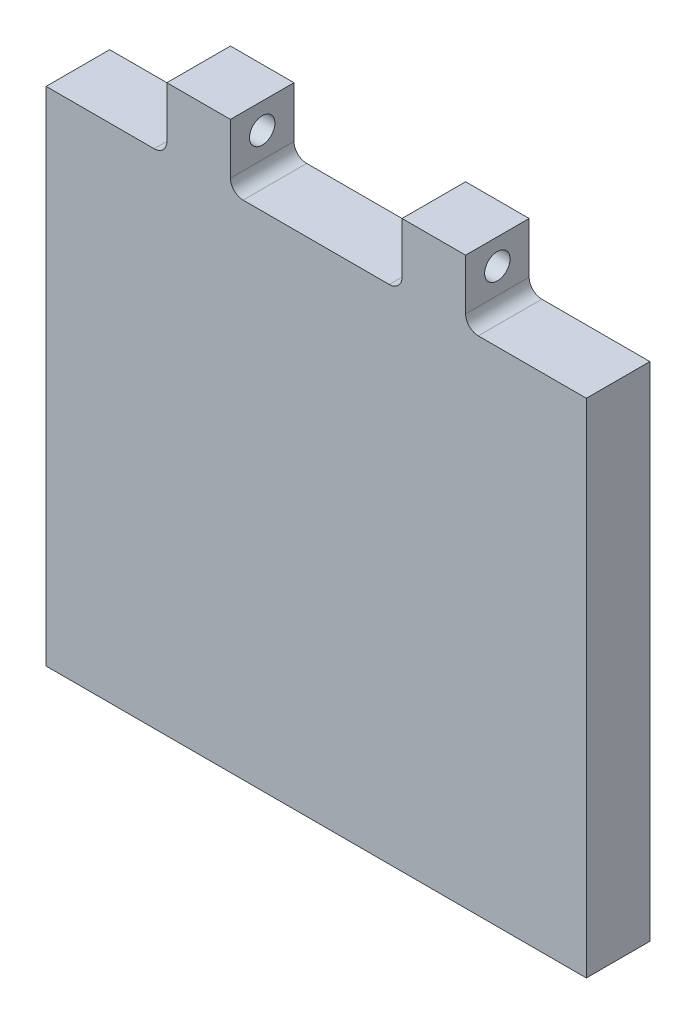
from build123d import *

# Parameters (mm, degrees)
EXTRUSION1_DEPTH        = 10
ESQUISSE2_R             = 2
ENL_V_MAT_EXTRU_1_DEPTH = 112.251966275


with BuildPart() as part:
    # Esquisse1 → Extrusion1 (new body)
    with BuildSketch(Plane.XY):
        with BuildLine():
            Line((42.5, 0), (-42.5, 0))
            Line((-42.5, 0), (-42.5, 79))
            Line((-42.5, 79), (-25.5, 79))
            ThreePointArc((-25.5, 79), (-24.085786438, 79.585786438), (-23.5, 81))
            Line((-23.5, 81), (-23.5, 89))
            Line((-23.5, 89), (-13.5, 89))
            Line((-13.5, 89), (-13.5, 81))
            ThreePointArc((-13.5, 81), (-12.914213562, 79.585786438), (-11.5, 79))
            Line((-11.5, 79), (11.5, 79))
            ThreePointArc((11.5, 79), (12.914213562, 79.585786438), (13.5, 81))
            Line((13.5, 81), (13.5, 89))
            Line((13.5, 89), (23.5, 89))
            Line((23.5, 89), (23.5, 81))
            ThreePointArc((23.5, 81), (24.085786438, 79.585786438), (25.5, 79))
            Line((25.5, 79), (42.5, 79))
            Line((42.5, 79), (42.5, 0))
        make_face()
    extrude(amount=-EXTRUSION1_DEPTH)

    # Esquisse2 → Enl_v. mat.-Extru.1 (cut, through all)
    with BuildSketch(Plane.ZY.offset(23.5)):
        with Locations(Location((-5, 85, 0), (0, 0, 270))):
            Circle(ESQUISSE2_R)
    extrude(amount=-ENL_V_MAT_EXTRU_1_DEPTH, mode=Mode.SUBTRACT)


solid = part.part
